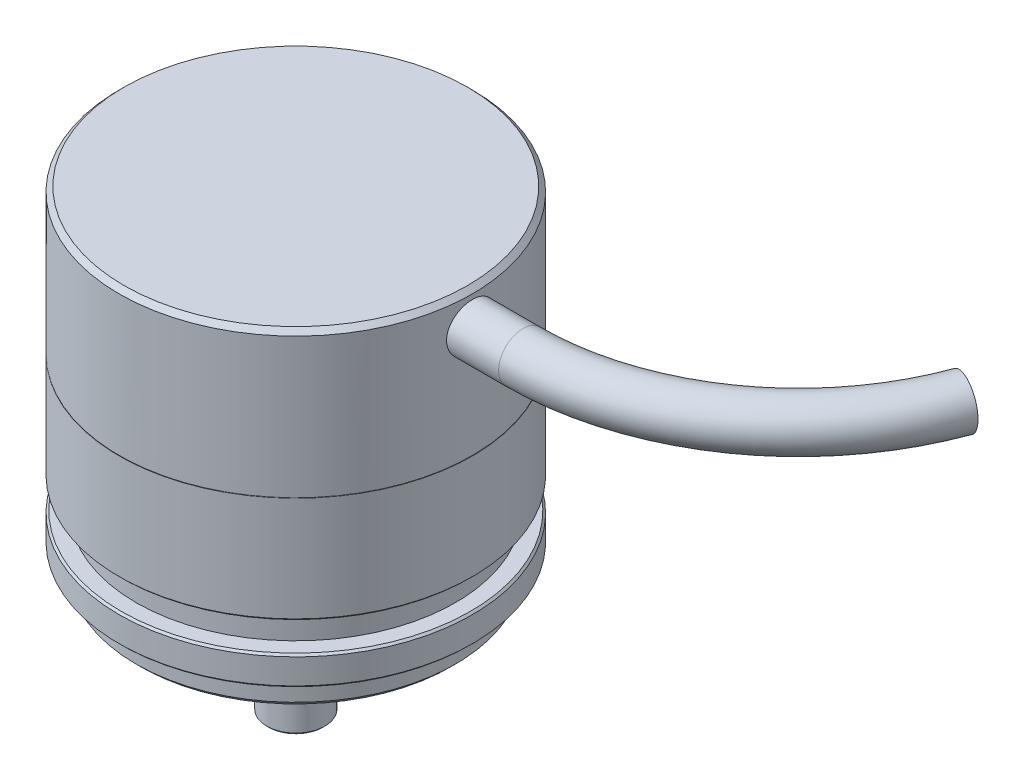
ISO-10303-21;
HEADER;
FILE_DESCRIPTION(('STEP AP214'),'2;1');
FILE_NAME('part.step','',(''),(''),'','','');
FILE_SCHEMA(('AUTOMOTIVE_DESIGN { 1 0 10303 214 1 1 1 1 }'));
ENDSEC;
DATA;
#1=APPLICATION_CONTEXT('core data for automotive mechanical design processes');
#2=APPLICATION_PROTOCOL_DEFINITION('international standard','automotive_design',2000,#1);
#3=PRODUCT_CONTEXT('',#1,'mechanical');
#4=PRODUCT('Part','Part','',(#3));
#5=PRODUCT_RELATED_PRODUCT_CATEGORY('part','',(#4));
#6=PRODUCT_DEFINITION_FORMATION('','',#4);
#7=PRODUCT_DEFINITION_CONTEXT('part definition',#1,'design');
#8=PRODUCT_DEFINITION('design','',#6,#7);
#9=PRODUCT_DEFINITION_SHAPE('','',#8);
#10=(LENGTH_UNIT() NAMED_UNIT(*) SI_UNIT(.MILLI.,.METRE.));
#11=(NAMED_UNIT(*) PLANE_ANGLE_UNIT() SI_UNIT($,.RADIAN.));
#12=(NAMED_UNIT(*) SI_UNIT($,.STERADIAN.) SOLID_ANGLE_UNIT());
#13=UNCERTAINTY_MEASURE_WITH_UNIT(LENGTH_MEASURE(1.E-05),#10,'distance_accuracy_value','');
#14=(GEOMETRIC_REPRESENTATION_CONTEXT(3) GLOBAL_UNCERTAINTY_ASSIGNED_CONTEXT((#13)) GLOBAL_UNIT_ASSIGNED_CONTEXT((#10,
#11,#12)) REPRESENTATION_CONTEXT('',''));
#15=CARTESIAN_POINT('',(0.,0.,0.));
#16=DIRECTION('',(0.,0.,1.));
#17=DIRECTION('',(1.,0.,0.));
#18=AXIS2_PLACEMENT_3D('',#15,#16,#17);
#19=CARTESIAN_POINT('',(31.5463232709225,-10.9999999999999,0.));
#20=DIRECTION('',(0.,-1.,0.));
#21=DIRECTION('',(0.,0.,-1.));
#22=AXIS2_PLACEMENT_3D('',#19,#20,#21);
#23=CYLINDRICAL_SURFACE('',#22,18.25);
#24=CARTESIAN_POINT('',(31.5463232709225,21.05,0.));
#25=DIRECTION('',(0.,-1.,0.));
#26=DIRECTION('',(0.,0.,-1.));
#27=AXIS2_PLACEMENT_3D('',#24,#25,#26);
#28=CIRCLE('',#27,18.25);
#29=CARTESIAN_POINT('',(31.5463232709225,21.05,-18.25));
#30=VERTEX_POINT('',#29);
#31=EDGE_CURVE('E83',#30,#30,#28,.T.);
#32=ORIENTED_EDGE('',*,*,#31,.F.);
#33=EDGE_LOOP('',(#32));
#34=FACE_BOUND('',#33,.T.);
#35=CARTESIAN_POINT('',(31.5463232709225,35.5000000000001,0.));
#36=DIRECTION('',(0.,1.,0.));
#37=DIRECTION('',(0.,0.,1.));
#38=AXIS2_PLACEMENT_3D('',#35,#36,#37);
#39=CIRCLE('',#38,18.25);
#40=CARTESIAN_POINT('',(31.5463232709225,35.5000000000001,18.25));
#41=VERTEX_POINT('',#40);
#42=EDGE_CURVE('E134',#41,#41,#39,.F.);
#43=ORIENTED_EDGE('',*,*,#42,.T.);
#44=EDGE_LOOP('',(#43));
#45=FACE_BOUND('',#44,.T.);
#46=CARTESIAN_POINT('',(49.6242794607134,32.5000000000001,2.5));
#47=CARTESIAN_POINT('',(49.6242816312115,32.6397174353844,2.49999413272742));
#48=CARTESIAN_POINT('',(49.625916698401,32.77951935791,2.48824786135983));
#49=CARTESIAN_POINT('',(49.6322769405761,33.0552242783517,2.44158003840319));
#50=CARTESIAN_POINT('',(49.6370052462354,33.1911231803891,2.40663500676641));
#51=CARTESIAN_POINT('',(49.6490065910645,33.4549908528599,2.31462632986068));
#52=CARTESIAN_POINT('',(49.656277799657,33.5829652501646,2.25757859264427));
#53=CARTESIAN_POINT('',(49.6725434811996,33.8275035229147,2.12301957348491));
#54=CARTESIAN_POINT('',(49.6815376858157,33.9440691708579,2.0455114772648));
#55=CARTESIAN_POINT('',(49.7003033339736,34.1632828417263,1.8716768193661));
#56=CARTESIAN_POINT('',(49.7100791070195,34.2658433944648,1.7752404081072));
#57=CARTESIAN_POINT('',(49.7292676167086,34.4533788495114,1.56652348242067));
#58=CARTESIAN_POINT('',(49.7386803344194,34.5383528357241,1.45424214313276));
#59=CARTESIAN_POINT('',(49.7561269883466,34.6886212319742,1.21646759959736));
#60=CARTESIAN_POINT('',(49.7641552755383,34.7538357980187,1.0909234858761));
#61=CARTESIAN_POINT('',(49.7778807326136,34.8622223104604,0.830536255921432));
#62=CARTESIAN_POINT('',(49.7835780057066,34.905395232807,0.695693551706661));
#63=CARTESIAN_POINT('',(49.7919689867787,34.9682097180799,0.421434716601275));
#64=CARTESIAN_POINT('',(49.7946813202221,34.9879972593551,0.28205259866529));
#65=CARTESIAN_POINT('',(49.7968605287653,35.0039320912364,0.00192162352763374));
#66=CARTESIAN_POINT('',(49.7963275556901,35.0000804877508,-0.138827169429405));
#67=CARTESIAN_POINT('',(49.7920911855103,34.968962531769,-0.41670170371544));
#68=CARTESIAN_POINT('',(49.7884090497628,34.9418531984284,-0.553845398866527));
#69=CARTESIAN_POINT('',(49.7783118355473,34.8652352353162,-0.821618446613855));
#70=CARTESIAN_POINT('',(49.7718966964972,34.815726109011,-0.952247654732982));
#71=CARTESIAN_POINT('',(49.7570176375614,34.6955498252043,-1.20376478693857));
#72=CARTESIAN_POINT('',(49.7485472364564,34.6248155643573,-1.32462024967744));
#73=CARTESIAN_POINT('',(49.7305036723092,34.4642457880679,-1.55280520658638));
#74=CARTESIAN_POINT('',(49.7209304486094,34.3744092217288,-1.66013395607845));
#75=CARTESIAN_POINT('',(49.7016581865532,34.1773076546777,-1.85914274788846));
#76=CARTESIAN_POINT('',(49.6919587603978,34.0699056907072,-1.95068715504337));
#77=CARTESIAN_POINT('',(49.6736043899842,33.8411901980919,-2.11447221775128));
#78=CARTESIAN_POINT('',(49.6649494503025,33.7198766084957,-2.18671278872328));
#79=CARTESIAN_POINT('',(49.6496642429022,33.4666513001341,-2.30985209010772));
#80=CARTESIAN_POINT('',(49.6430351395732,33.3347335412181,-2.36073855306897));
#81=CARTESIAN_POINT('',(49.6325738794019,33.0641136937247,-2.43959751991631));
#82=CARTESIAN_POINT('',(49.628741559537,32.9254120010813,-2.46757135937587));
#83=CARTESIAN_POINT('',(49.6243381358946,32.6463634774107,-2.4996284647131));
#84=CARTESIAN_POINT('',(49.6237408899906,32.5060390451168,-2.5039032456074));
#85=CARTESIAN_POINT('',(49.6258059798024,32.2266759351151,-2.48894751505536));
#86=CARTESIAN_POINT('',(49.628468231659,32.0876372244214,-2.46971760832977));
#87=CARTESIAN_POINT('',(49.6367284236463,31.8153751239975,-2.40846016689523));
#88=CARTESIAN_POINT('',(49.6423142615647,31.6821301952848,-2.36652658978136));
#89=CARTESIAN_POINT('',(49.6557823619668,31.4245616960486,-2.26114932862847));
#90=CARTESIAN_POINT('',(49.663664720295,31.3002384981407,-2.19770474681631));
#91=CARTESIAN_POINT('',(49.6808998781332,31.0631797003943,-2.05064048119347));
#92=CARTESIAN_POINT('',(49.6902616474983,30.9505222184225,-1.96689594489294));
#93=CARTESIAN_POINT('',(49.7093731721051,30.7407925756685,-1.78178411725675));
#94=CARTESIAN_POINT('',(49.719122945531,30.6437211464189,-1.68041599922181));
#95=CARTESIAN_POINT('',(49.7379928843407,30.4672394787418,-1.46209472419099));
#96=CARTESIAN_POINT('',(49.7471082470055,30.38795558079,-1.34503896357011));
#97=CARTESIAN_POINT('',(49.7636092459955,30.2501764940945,-1.09915992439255));
#98=CARTESIAN_POINT('',(49.7709949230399,30.1916808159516,-0.970336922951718));
#99=CARTESIAN_POINT('',(49.7831832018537,30.0973441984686,-0.704988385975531));
#100=CARTESIAN_POINT('',(49.7879939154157,30.0614320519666,-0.56848855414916));
#101=CARTESIAN_POINT('',(49.7945240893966,30.01305077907,-0.291325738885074));
#102=CARTESIAN_POINT('',(49.7962437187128,30.0005803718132,-0.150662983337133));
#103=CARTESIAN_POINT('',(49.7963967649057,29.9994638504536,0.129602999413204));
#104=CARTESIAN_POINT('',(49.7948569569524,30.0106236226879,0.269205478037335));
#105=CARTESIAN_POINT('',(49.7887176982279,30.0560372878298,0.544529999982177));
#106=CARTESIAN_POINT('',(49.7841182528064,30.0902911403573,0.680252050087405));
#107=CARTESIAN_POINT('',(49.7723740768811,30.1808559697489,0.943924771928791));
#108=CARTESIAN_POINT('',(49.7652306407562,30.2371557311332,1.07187935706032));
#109=CARTESIAN_POINT('',(49.7491865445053,30.3701939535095,1.31655594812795));
#110=CARTESIAN_POINT('',(49.7402858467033,30.446932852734,1.43327771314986));
#111=CARTESIAN_POINT('',(49.7216317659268,30.6193820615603,1.65316406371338));
#112=CARTESIAN_POINT('',(49.7118722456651,30.7152363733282,1.7562152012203));
#113=CARTESIAN_POINT('',(49.6926479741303,30.9228936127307,1.94484275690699));
#114=CARTESIAN_POINT('',(49.6831832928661,31.0347002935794,2.03041505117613));
#115=CARTESIAN_POINT('',(49.6655733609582,31.2716923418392,2.18200466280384));
#116=CARTESIAN_POINT('',(49.6574344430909,31.3969374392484,2.24792930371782));
#117=CARTESIAN_POINT('',(49.6434716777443,31.6567681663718,2.3577126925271));
#118=CARTESIAN_POINT('',(49.6376453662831,31.7913436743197,2.40159493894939));
#119=CARTESIAN_POINT('',(49.6303510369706,32.0221459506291,2.45579041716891));
#120=CARTESIAN_POINT('',(49.6280858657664,32.1169299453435,2.47234448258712));
#121=CARTESIAN_POINT('',(49.6250493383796,32.3077959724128,2.49445123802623));
#122=CARTESIAN_POINT('',(49.6242779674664,32.4038779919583,2.50000403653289));
#123=CARTESIAN_POINT('',(49.6242794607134,32.5000000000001,2.5));
#124=B_SPLINE_CURVE_WITH_KNOTS('',3,(#46,#47,#48,#49,#50,#51,#52,#53,#54,#55,#56,#57,#58,#59,
#60,#61,#62,#63,#64,#65,#66,#67,#68,#69,#70,#71,#72,#73,#74,#75,#76,#77,#78,#79,#80,#81,#82,#83,
#84,#85,#86,#87,#88,#89,#90,#91,#92,#93,#94,#95,#96,#97,#98,#99,#100,#101,#102,#103,#104,#105,
#106,#107,#108,#109,#110,#111,#112,#113,#114,#115,#116,#117,#118,#119,#120,#121,#122,#123),
.UNSPECIFIED.,.T.,.F.,(4,2,2,2,2,2,2,2,2,2,2,2,2,2,2,2,2,2,2,2,2,2,2,2,2,2,2,2,2,2,2,2,2,2,2,2,
2,2,4),(0.,0.418801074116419,0.838026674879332,1.2569511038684,1.67581034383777,
2.09717639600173,2.5185643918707,2.94163309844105,3.36468307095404,3.78507805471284,
4.20545337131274,4.62301275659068,5.04058139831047,5.45948434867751,5.87841035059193,
6.3007739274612,6.72313935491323,7.14574709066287,7.56833019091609,7.98749331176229,
8.40664564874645,8.82407646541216,9.2415247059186,9.66160863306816,10.0817122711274,
10.5047114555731,10.9277006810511,11.3493494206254,11.7709751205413,12.1891507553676,
12.6073256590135,13.0252880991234,13.4432595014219,13.864507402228,14.2858545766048,
14.7091588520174,15.1320108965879,15.420138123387,15.7082625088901),.UNSPECIFIED.);
#125=CARTESIAN_POINT('',(49.6242794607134,32.5000000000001,2.5));
#126=VERTEX_POINT('',#125);
#127=EDGE_CURVE('E82',#126,#126,#124,.T.);
#128=ORIENTED_EDGE('',*,*,#127,.T.);
#129=EDGE_LOOP('',(#128));
#130=FACE_BOUND('',#129,.T.);
#131=ADVANCED_FACE('F35',(#34,#45,#130),#23,.T.);
#132=CARTESIAN_POINT('',(31.5463232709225,-10.9999999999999,0.));
#133=DIRECTION('',(0.,-1.,0.));
#134=DIRECTION('',(0.,0.,-1.));
#135=AXIS2_PLACEMENT_3D('',#132,#133,#134);
#136=PLANE('',#135);
#137=CARTESIAN_POINT('',(31.5463232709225,-10.9999999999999,0.));
#138=DIRECTION('',(0.,-1.,0.));
#139=DIRECTION('',(0.,0.,-1.));
#140=AXIS2_PLACEMENT_3D('',#137,#138,#139);
#141=CIRCLE('',#140,2.8);
#142=CARTESIAN_POINT('',(31.5463232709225,-10.9999999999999,-2.8));
#143=VERTEX_POINT('',#142);
#144=EDGE_CURVE('E592',#143,#143,#141,.T.);
#145=ORIENTED_EDGE('',*,*,#144,.T.);
#146=EDGE_LOOP('',(#145));
#147=FACE_BOUND('',#146,.T.);
#148=ADVANCED_FACE('F180',(#147),#136,.T.);
#149=CARTESIAN_POINT('',(31.5463232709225,-10.9999999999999,0.));
#150=DIRECTION('',(0.,-1.,0.));
#151=DIRECTION('',(0.,0.,-1.));
#152=AXIS2_PLACEMENT_3D('',#149,#150,#151);
#153=CYLINDRICAL_SURFACE('',#152,3.);
#154=CARTESIAN_POINT('',(31.5463232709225,-10.7999999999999,0.));
#155=DIRECTION('',(0.,-1.,0.));
#156=DIRECTION('',(0.,0.,-1.));
#157=AXIS2_PLACEMENT_3D('',#154,#155,#156);
#158=CIRCLE('',#157,3.);
#159=CARTESIAN_POINT('',(31.5463232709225,-10.7999999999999,-3.));
#160=VERTEX_POINT('',#159);
#161=EDGE_CURVE('E589',#160,#160,#158,.F.);
#162=ORIENTED_EDGE('',*,*,#161,.T.);
#163=EDGE_LOOP('',(#162));
#164=FACE_BOUND('',#163,.T.);
#165=CARTESIAN_POINT('',(31.5463232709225,1.1,0.));
#166=DIRECTION('',(0.,-1.,0.));
#167=DIRECTION('',(0.,0.,-1.));
#168=AXIS2_PLACEMENT_3D('',#165,#166,#167);
#169=CIRCLE('',#168,3.);
#170=CARTESIAN_POINT('',(31.5463232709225,1.1,-3.));
#171=VERTEX_POINT('',#170);
#172=EDGE_CURVE('E131',#171,#171,#169,.T.);
#173=ORIENTED_EDGE('',*,*,#172,.T.);
#174=EDGE_LOOP('',(#173));
#175=FACE_BOUND('',#174,.T.);
#176=ADVANCED_FACE('F185',(#164,#175),#153,.T.);
#177=CARTESIAN_POINT('',(31.5463232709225,1.1,0.));
#178=DIRECTION('',(0.,-1.,0.));
#179=DIRECTION('',(0.,0.,-1.));
#180=AXIS2_PLACEMENT_3D('',#177,#178,#179);
#181=CONICAL_SURFACE('',#180,3.,0.803447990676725);
#182=CARTESIAN_POINT('',(31.5463232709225,0.999999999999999,0.));
#183=DIRECTION('',(0.,-1.,0.));
#184=DIRECTION('',(0.,0.,-1.));
#185=AXIS2_PLACEMENT_3D('',#182,#183,#184);
#186=CIRCLE('',#185,3.10367672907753);
#187=CARTESIAN_POINT('',(31.5463232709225,0.999999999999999,-3.10367672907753));
#188=VERTEX_POINT('',#187);
#189=EDGE_CURVE('E128',#188,#188,#186,.T.);
#190=ORIENTED_EDGE('',*,*,#189,.T.);
#191=EDGE_LOOP('',(#190));
#192=FACE_BOUND('',#191,.T.);
#193=ORIENTED_EDGE('',*,*,#172,.F.);
#194=EDGE_LOOP('',(#193));
#195=FACE_BOUND('',#194,.T.);
#196=ADVANCED_FACE('F559',(#192,#195),#181,.F.);
#197=CARTESIAN_POINT('',(34.65,1.,0.));
#198=DIRECTION('',(0.,-1.,0.));
#199=DIRECTION('',(0.,0.,-1.));
#200=AXIS2_PLACEMENT_3D('',#197,#198,#199);
#201=PLANE('',#200);
#202=CARTESIAN_POINT('',(31.5463232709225,0.999999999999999,0.));
#203=DIRECTION('',(0.,-1.,0.));
#204=DIRECTION('',(0.,0.,-1.));
#205=AXIS2_PLACEMENT_3D('',#202,#203,#204);
#206=CIRCLE('',#205,3.85367672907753);
#207=CARTESIAN_POINT('',(31.5463232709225,0.999999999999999,-3.85367672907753));
#208=VERTEX_POINT('',#207);
#209=EDGE_CURVE('E125',#208,#208,#206,.T.);
#210=ORIENTED_EDGE('',*,*,#209,.T.);
#211=EDGE_LOOP('',(#210));
#212=FACE_BOUND('',#211,.T.);
#213=ORIENTED_EDGE('',*,*,#189,.F.);
#214=EDGE_LOOP('',(#213));
#215=FACE_BOUND('',#214,.T.);
#216=ADVANCED_FACE('F549',(#212,#215),#201,.T.);
#217=CARTESIAN_POINT('',(31.5463232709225,-10.9999999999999,0.));
#218=DIRECTION('',(0.,-1.,0.));
#219=DIRECTION('',(0.,0.,-1.));
#220=AXIS2_PLACEMENT_3D('',#217,#218,#219);
#221=CYLINDRICAL_SURFACE('',#220,3.85367672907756);
#222=CARTESIAN_POINT('',(31.5463232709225,1.09999999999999,0.));
#223=DIRECTION('',(0.,-1.,0.));
#224=DIRECTION('',(0.,0.,-1.));
#225=AXIS2_PLACEMENT_3D('',#222,#223,#224);
#226=CIRCLE('',#225,3.85367672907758);
#227=CARTESIAN_POINT('',(31.5463232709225,1.09999999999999,-3.85367672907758));
#228=VERTEX_POINT('',#227);
#229=EDGE_CURVE('E122',#228,#228,#226,.T.);
#230=ORIENTED_EDGE('',*,*,#229,.T.);
#231=EDGE_LOOP('',(#230));
#232=FACE_BOUND('',#231,.T.);
#233=ORIENTED_EDGE('',*,*,#209,.F.);
#234=EDGE_LOOP('',(#233));
#235=FACE_BOUND('',#234,.T.);
#236=ADVANCED_FACE('F537',(#232,#235),#221,.T.);
#237=CARTESIAN_POINT('',(39.5,1.1,0.));
#238=DIRECTION('',(0.,-1.,0.));
#239=DIRECTION('',(0.,0.,-1.));
#240=AXIS2_PLACEMENT_3D('',#237,#238,#239);
#241=PLANE('',#240);
#242=CARTESIAN_POINT('',(31.5463232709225,1.1,0.));
#243=DIRECTION('',(0.,-1.,0.));
#244=DIRECTION('',(0.,0.,-1.));
#245=AXIS2_PLACEMENT_3D('',#242,#243,#244);
#246=CIRCLE('',#245,8.20367672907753);
#247=CARTESIAN_POINT('',(31.5463232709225,1.1,-8.20367672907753));
#248=VERTEX_POINT('',#247);
#249=EDGE_CURVE('E119',#248,#248,#246,.T.);
#250=ORIENTED_EDGE('',*,*,#249,.T.);
#251=EDGE_LOOP('',(#250));
#252=FACE_BOUND('',#251,.T.);
#253=ORIENTED_EDGE('',*,*,#229,.F.);
#254=EDGE_LOOP('',(#253));
#255=FACE_BOUND('',#254,.T.);
#256=ADVANCED_FACE('F528',(#252,#255),#241,.T.);
#257=CARTESIAN_POINT('',(31.5463232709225,-10.9999999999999,0.));
#258=DIRECTION('',(0.,-1.,0.));
#259=DIRECTION('',(0.,0.,-1.));
#260=AXIS2_PLACEMENT_3D('',#257,#258,#259);
#261=CYLINDRICAL_SURFACE('',#260,8.20367672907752);
#262=CARTESIAN_POINT('',(31.5463232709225,1.01470093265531,0.));
#263=DIRECTION('',(0.,-1.,0.));
#264=DIRECTION('',(0.,0.,-1.));
#265=AXIS2_PLACEMENT_3D('',#262,#263,#264);
#266=CIRCLE('',#265,8.20367672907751);
#267=CARTESIAN_POINT('',(31.5463232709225,1.01470093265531,-8.20367672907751));
#268=VERTEX_POINT('',#267);
#269=EDGE_CURVE('E116',#268,#268,#266,.T.);
#270=ORIENTED_EDGE('',*,*,#269,.T.);
#271=EDGE_LOOP('',(#270));
#272=FACE_BOUND('',#271,.T.);
#273=ORIENTED_EDGE('',*,*,#249,.F.);
#274=EDGE_LOOP('',(#273));
#275=FACE_BOUND('',#274,.T.);
#276=ADVANCED_FACE('F519',(#272,#275),#261,.F.);
#277=CARTESIAN_POINT('',(39.75,1.01470093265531,0.));
#278=DIRECTION('',(0.,-1.,0.));
#279=DIRECTION('',(0.,0.,-1.));
#280=AXIS2_PLACEMENT_3D('',#277,#278,#279);
#281=PLANE('',#280);
#282=CARTESIAN_POINT('',(31.5463232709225,1.01470093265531,0.));
#283=DIRECTION('',(0.,-1.,0.));
#284=DIRECTION('',(0.,0.,-1.));
#285=AXIS2_PLACEMENT_3D('',#282,#283,#284);
#286=CIRCLE('',#285,9.435061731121);
#287=CARTESIAN_POINT('',(31.5463232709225,1.01470093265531,-9.435061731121));
#288=VERTEX_POINT('',#287);
#289=EDGE_CURVE('E113',#288,#288,#286,.T.);
#290=ORIENTED_EDGE('',*,*,#289,.T.);
#291=EDGE_LOOP('',(#290));
#292=FACE_BOUND('',#291,.T.);
#293=ORIENTED_EDGE('',*,*,#269,.F.);
#294=EDGE_LOOP('',(#293));
#295=FACE_BOUND('',#294,.T.);
#296=ADVANCED_FACE('F510',(#292,#295),#281,.T.);
#297=CARTESIAN_POINT('',(31.5463232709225,-10.9999999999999,0.));
#298=DIRECTION('',(0.,-1.,0.));
#299=DIRECTION('',(0.,0.,-1.));
#300=AXIS2_PLACEMENT_3D('',#297,#298,#299);
#301=CYLINDRICAL_SURFACE('',#300,9.43506173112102);
#302=CARTESIAN_POINT('',(31.5463232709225,1.09999999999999,0.));
#303=DIRECTION('',(0.,-1.,0.));
#304=DIRECTION('',(0.,0.,-1.));
#305=AXIS2_PLACEMENT_3D('',#302,#303,#304);
#306=CIRCLE('',#305,9.43506173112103);
#307=CARTESIAN_POINT('',(31.5463232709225,1.09999999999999,-9.43506173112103));
#308=VERTEX_POINT('',#307);
#309=EDGE_CURVE('E110',#308,#308,#306,.T.);
#310=ORIENTED_EDGE('',*,*,#309,.T.);
#311=EDGE_LOOP('',(#310));
#312=FACE_BOUND('',#311,.T.);
#313=ORIENTED_EDGE('',*,*,#289,.F.);
#314=EDGE_LOOP('',(#313));
#315=FACE_BOUND('',#314,.T.);
#316=ADVANCED_FACE('F501',(#312,#315),#301,.T.);
#317=CARTESIAN_POINT('',(40.9813850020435,1.10000000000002,0.));
#318=DIRECTION('',(0.,-1.,0.));
#319=DIRECTION('',(0.,0.,-1.));
#320=AXIS2_PLACEMENT_3D('',#317,#318,#319);
#321=PLANE('',#320);
#322=CARTESIAN_POINT('',(31.5463232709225,1.10000000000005,0.));
#323=DIRECTION('',(0.,-1.,0.));
#324=DIRECTION('',(0.,0.,-1.));
#325=AXIS2_PLACEMENT_3D('',#322,#323,#324);
#326=CIRCLE('',#325,9.54999999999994);
#327=CARTESIAN_POINT('',(31.5463232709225,1.10000000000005,-9.54999999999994));
#328=VERTEX_POINT('',#327);
#329=EDGE_CURVE('E107',#328,#328,#326,.T.);
#330=ORIENTED_EDGE('',*,*,#329,.T.);
#331=EDGE_LOOP('',(#330));
#332=FACE_BOUND('',#331,.T.);
#333=ORIENTED_EDGE('',*,*,#309,.F.);
#334=EDGE_LOOP('',(#333));
#335=FACE_BOUND('',#334,.T.);
#336=ADVANCED_FACE('F492',(#332,#335),#321,.T.);
#337=CARTESIAN_POINT('',(31.5463232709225,-10.9999999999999,0.));
#338=DIRECTION('',(0.,-1.,0.));
#339=DIRECTION('',(0.,0.,-1.));
#340=AXIS2_PLACEMENT_3D('',#337,#338,#339);
#341=CYLINDRICAL_SURFACE('',#340,9.54999999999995);
#342=CARTESIAN_POINT('',(31.5463232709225,1.00000000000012,0.));
#343=DIRECTION('',(0.,-1.,0.));
#344=DIRECTION('',(0.,0.,-1.));
#345=AXIS2_PLACEMENT_3D('',#342,#343,#344);
#346=CIRCLE('',#345,9.54999999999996);
#347=CARTESIAN_POINT('',(31.5463232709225,1.00000000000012,-9.54999999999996));
#348=VERTEX_POINT('',#347);
#349=EDGE_CURVE('E104',#348,#348,#346,.T.);
#350=ORIENTED_EDGE('',*,*,#349,.T.);
#351=EDGE_LOOP('',(#350));
#352=FACE_BOUND('',#351,.T.);
#353=ORIENTED_EDGE('',*,*,#329,.F.);
#354=EDGE_LOOP('',(#353));
#355=FACE_BOUND('',#354,.T.);
#356=ADVANCED_FACE('F483',(#352,#355),#341,.F.);
#357=CARTESIAN_POINT('',(41.0963232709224,1.00000000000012,0.));
#358=DIRECTION('',(0.,-1.,0.));
#359=DIRECTION('',(0.,0.,-1.));
#360=AXIS2_PLACEMENT_3D('',#357,#358,#359);
#361=PLANE('',#360);
#362=CARTESIAN_POINT('',(22.3539351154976,1.00000000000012,-9.19238815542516));
#363=DIRECTION('',(0.,-1.,0.));
#364=DIRECTION('',(0.,0.,-1.));
#365=AXIS2_PLACEMENT_3D('',#362,#363,#364);
#366=CIRCLE('',#365,1.55);
#367=CARTESIAN_POINT('',(22.3539351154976,1.00000000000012,-10.7423881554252));
#368=VERTEX_POINT('',#367);
#369=EDGE_CURVE('E607',#368,#368,#366,.F.);
#370=ORIENTED_EDGE('',*,*,#369,.T.);
#371=EDGE_LOOP('',(#370));
#372=FACE_BOUND('',#371,.T.);
#373=CARTESIAN_POINT('',(40.7387114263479,1.00000000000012,-9.19238815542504));
#374=DIRECTION('',(0.,-1.,0.));
#375=DIRECTION('',(0.,0.,-1.));
#376=AXIS2_PLACEMENT_3D('',#373,#374,#375);
#377=CIRCLE('',#376,1.55);
#378=CARTESIAN_POINT('',(40.7387114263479,1.00000000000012,-10.742388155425));
#379=VERTEX_POINT('',#378);
#380=EDGE_CURVE('E610',#379,#379,#377,.F.);
#381=ORIENTED_EDGE('',*,*,#380,.T.);
#382=EDGE_LOOP('',(#381));
#383=FACE_BOUND('',#382,.T.);
#384=CARTESIAN_POINT('',(40.7387114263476,1.00000000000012,9.19238815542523));
#385=DIRECTION('',(0.,-1.,0.));
#386=DIRECTION('',(0.,0.,-1.));
#387=AXIS2_PLACEMENT_3D('',#384,#385,#386);
#388=CIRCLE('',#387,1.55);
#389=CARTESIAN_POINT('',(40.7387114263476,1.00000000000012,7.64238815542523));
#390=VERTEX_POINT('',#389);
#391=EDGE_CURVE('E613',#390,#390,#388,.F.);
#392=ORIENTED_EDGE('',*,*,#391,.T.);
#393=EDGE_LOOP('',(#392));
#394=FACE_BOUND('',#393,.T.);
#395=CARTESIAN_POINT('',(22.3539351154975,1.00000000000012,9.19238815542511));
#396=DIRECTION('',(0.,-1.,0.));
#397=DIRECTION('',(0.,0.,-1.));
#398=AXIS2_PLACEMENT_3D('',#395,#396,#397);
#399=CIRCLE('',#398,1.55);
#400=CARTESIAN_POINT('',(22.3539351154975,1.00000000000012,7.64238815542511));
#401=VERTEX_POINT('',#400);
#402=EDGE_CURVE('E616',#401,#401,#399,.F.);
#403=ORIENTED_EDGE('',*,*,#402,.T.);
#404=EDGE_LOOP('',(#403));
#405=FACE_BOUND('',#404,.T.);
#406=CARTESIAN_POINT('',(31.5463232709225,1.00000000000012,0.));
#407=DIRECTION('',(0.,-1.,0.));
#408=DIRECTION('',(0.,0.,-1.));
#409=AXIS2_PLACEMENT_3D('',#406,#407,#408);
#410=CIRCLE('',#409,16.);
#411=CARTESIAN_POINT('',(31.5463232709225,1.00000000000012,-16.));
#412=VERTEX_POINT('',#411);
#413=EDGE_CURVE('E140',#412,#412,#410,.T.);
#414=ORIENTED_EDGE('',*,*,#413,.T.);
#415=EDGE_LOOP('',(#414));
#416=FACE_BOUND('',#415,.T.);
#417=ORIENTED_EDGE('',*,*,#349,.F.);
#418=EDGE_LOOP('',(#417));
#419=FACE_BOUND('',#418,.T.);
#420=ADVANCED_FACE('F475',(#372,#383,#394,#405,#416,#419),#361,.T.);
#421=CARTESIAN_POINT('',(31.5463232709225,-10.9999999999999,0.));
#422=DIRECTION('',(0.,-1.,0.));
#423=DIRECTION('',(0.,0.,-1.));
#424=AXIS2_PLACEMENT_3D('',#421,#422,#423);
#425=CYLINDRICAL_SURFACE('',#424,16.5);
#426=CARTESIAN_POINT('',(31.5463232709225,1.50000000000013,0.));
#427=DIRECTION('',(0.,-1.,0.));
#428=DIRECTION('',(0.,0.,-1.));
#429=AXIS2_PLACEMENT_3D('',#426,#427,#428);
#430=CIRCLE('',#429,16.5);
#431=CARTESIAN_POINT('',(31.5463232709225,1.50000000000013,-16.5));
#432=VERTEX_POINT('',#431);
#433=EDGE_CURVE('E143',#432,#432,#430,.F.);
#434=ORIENTED_EDGE('',*,*,#433,.T.);
#435=EDGE_LOOP('',(#434));
#436=FACE_BOUND('',#435,.T.);
#437=CARTESIAN_POINT('',(31.5463232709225,4.00000000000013,0.));
#438=DIRECTION('',(0.,-1.,0.));
#439=DIRECTION('',(0.,0.,-1.));
#440=AXIS2_PLACEMENT_3D('',#437,#438,#439);
#441=CIRCLE('',#440,16.5);
#442=CARTESIAN_POINT('',(31.5463232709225,4.00000000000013,-16.5));
#443=VERTEX_POINT('',#442);
#444=EDGE_CURVE('E101',#443,#443,#441,.T.);
#445=ORIENTED_EDGE('',*,*,#444,.T.);
#446=EDGE_LOOP('',(#445));
#447=FACE_BOUND('',#446,.T.);
#448=ADVANCED_FACE('F466',(#436,#447),#425,.T.);
#449=CARTESIAN_POINT('',(49.7963232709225,4.00000000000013,0.));
#450=DIRECTION('',(0.,-1.,0.));
#451=DIRECTION('',(0.,0.,-1.));
#452=AXIS2_PLACEMENT_3D('',#449,#450,#451);
#453=PLANE('',#452);
#454=CARTESIAN_POINT('',(31.5463232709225,4.00000000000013,0.));
#455=DIRECTION('',(0.,-1.,0.));
#456=DIRECTION('',(0.,0.,-1.));
#457=AXIS2_PLACEMENT_3D('',#454,#455,#456);
#458=CIRCLE('',#457,18.05);
#459=CARTESIAN_POINT('',(31.5463232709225,4.00000000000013,-18.05));
#460=VERTEX_POINT('',#459);
#461=EDGE_CURVE('E146',#460,#460,#458,.T.);
#462=ORIENTED_EDGE('',*,*,#461,.T.);
#463=EDGE_LOOP('',(#462));
#464=FACE_BOUND('',#463,.T.);
#465=ORIENTED_EDGE('',*,*,#444,.F.);
#466=EDGE_LOOP('',(#465));
#467=FACE_BOUND('',#466,.T.);
#468=ADVANCED_FACE('F457',(#464,#467),#453,.T.);
#469=CARTESIAN_POINT('',(31.5463232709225,-10.9999999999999,0.));
#470=DIRECTION('',(0.,-1.,0.));
#471=DIRECTION('',(0.,0.,-1.));
#472=AXIS2_PLACEMENT_3D('',#469,#470,#471);
#473=CYLINDRICAL_SURFACE('',#472,18.25);
#474=CARTESIAN_POINT('',(31.5463232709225,4.20000000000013,0.));
#475=DIRECTION('',(0.,-1.,0.));
#476=DIRECTION('',(0.,0.,-1.));
#477=AXIS2_PLACEMENT_3D('',#474,#475,#476);
#478=CIRCLE('',#477,18.25);
#479=CARTESIAN_POINT('',(31.5463232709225,4.20000000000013,-18.25));
#480=VERTEX_POINT('',#479);
#481=EDGE_CURVE('E625',#480,#480,#478,.F.);
#482=ORIENTED_EDGE('',*,*,#481,.T.);
#483=EDGE_LOOP('',(#482));
#484=FACE_BOUND('',#483,.T.);
#485=CARTESIAN_POINT('',(31.5463232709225,6.80000000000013,0.));
#486=DIRECTION('',(0.,1.,0.));
#487=DIRECTION('',(0.,0.,1.));
#488=AXIS2_PLACEMENT_3D('',#485,#486,#487);
#489=CIRCLE('',#488,18.25);
#490=CARTESIAN_POINT('',(31.5463232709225,6.80000000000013,18.25));
#491=VERTEX_POINT('',#490);
#492=EDGE_CURVE('E627',#491,#491,#489,.F.);
#493=ORIENTED_EDGE('',*,*,#492,.T.);
#494=EDGE_LOOP('',(#493));
#495=FACE_BOUND('',#494,.T.);
#496=ADVANCED_FACE('F448',(#484,#495),#473,.T.);
#497=CARTESIAN_POINT('',(49.7963232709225,7.00000000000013,0.));
#498=DIRECTION('',(0.,1.,0.));
#499=DIRECTION('',(0.,0.,1.));
#500=AXIS2_PLACEMENT_3D('',#497,#498,#499);
#501=PLANE('',#500);
#502=CARTESIAN_POINT('',(31.5463232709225,7.00000000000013,0.));
#503=DIRECTION('',(0.,1.,0.));
#504=DIRECTION('',(0.,0.,1.));
#505=AXIS2_PLACEMENT_3D('',#502,#503,#504);
#506=CIRCLE('',#505,18.05);
#507=CARTESIAN_POINT('',(31.5463232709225,7.00000000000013,18.05));
#508=VERTEX_POINT('',#507);
#509=EDGE_CURVE('E622',#508,#508,#506,.T.);
#510=ORIENTED_EDGE('',*,*,#509,.T.);
#511=EDGE_LOOP('',(#510));
#512=FACE_BOUND('',#511,.T.);
#513=CARTESIAN_POINT('',(31.5463232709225,7.00000000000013,0.));
#514=DIRECTION('',(0.,-1.,0.));
#515=DIRECTION('',(0.,0.,-1.));
#516=AXIS2_PLACEMENT_3D('',#513,#514,#515);
#517=CIRCLE('',#516,16.5);
#518=CARTESIAN_POINT('',(31.5463232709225,7.00000000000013,-16.5));
#519=VERTEX_POINT('',#518);
#520=EDGE_CURVE('E98',#519,#519,#517,.T.);
#521=ORIENTED_EDGE('',*,*,#520,.T.);
#522=EDGE_LOOP('',(#521));
#523=FACE_BOUND('',#522,.T.);
#524=ADVANCED_FACE('F439',(#512,#523),#501,.T.);
#525=CARTESIAN_POINT('',(31.5463232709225,-10.9999999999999,0.));
#526=DIRECTION('',(0.,-1.,0.));
#527=DIRECTION('',(0.,0.,-1.));
#528=AXIS2_PLACEMENT_3D('',#525,#526,#527);
#529=CYLINDRICAL_SURFACE('',#528,16.5);
#530=CARTESIAN_POINT('',(31.5463232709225,10.0000000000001,0.));
#531=DIRECTION('',(0.,-1.,0.));
#532=DIRECTION('',(0.,0.,-1.));
#533=AXIS2_PLACEMENT_3D('',#530,#531,#532);
#534=CIRCLE('',#533,16.5);
#535=CARTESIAN_POINT('',(31.5463232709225,10.0000000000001,-16.5));
#536=VERTEX_POINT('',#535);
#537=EDGE_CURVE('E95',#536,#536,#534,.T.);
#538=ORIENTED_EDGE('',*,*,#537,.T.);
#539=EDGE_LOOP('',(#538));
#540=FACE_BOUND('',#539,.T.);
#541=ORIENTED_EDGE('',*,*,#520,.F.);
#542=EDGE_LOOP('',(#541));
#543=FACE_BOUND('',#542,.T.);
#544=ADVANCED_FACE('F430',(#540,#543),#529,.T.);
#545=CARTESIAN_POINT('',(49.7963232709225,10.0000000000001,0.));
#546=DIRECTION('',(0.,-1.,0.));
#547=DIRECTION('',(0.,0.,-1.));
#548=AXIS2_PLACEMENT_3D('',#545,#546,#547);
#549=PLANE('',#548);
#550=CARTESIAN_POINT('',(31.5463232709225,10.0000000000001,0.));
#551=DIRECTION('',(0.,-1.,0.));
#552=DIRECTION('',(0.,0.,-1.));
#553=AXIS2_PLACEMENT_3D('',#550,#551,#552);
#554=CIRCLE('',#553,18.05);
#555=CARTESIAN_POINT('',(31.5463232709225,10.0000000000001,-18.05));
#556=VERTEX_POINT('',#555);
#557=EDGE_CURVE('E43',#556,#556,#554,.T.);
#558=ORIENTED_EDGE('',*,*,#557,.T.);
#559=EDGE_LOOP('',(#558));
#560=FACE_BOUND('',#559,.T.);
#561=ORIENTED_EDGE('',*,*,#537,.F.);
#562=EDGE_LOOP('',(#561));
#563=FACE_BOUND('',#562,.T.);
#564=ADVANCED_FACE('F421',(#560,#563),#549,.T.);
#565=CARTESIAN_POINT('',(31.5463232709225,-10.9999999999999,0.));
#566=DIRECTION('',(0.,-1.,0.));
#567=DIRECTION('',(0.,0.,-1.));
#568=AXIS2_PLACEMENT_3D('',#565,#566,#567);
#569=CYLINDRICAL_SURFACE('',#568,18.25);
#570=CARTESIAN_POINT('',(31.5463232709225,10.2000000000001,0.));
#571=DIRECTION('',(0.,-1.,0.));
#572=DIRECTION('',(0.,0.,-1.));
#573=AXIS2_PLACEMENT_3D('',#570,#571,#572);
#574=CIRCLE('',#573,18.25);
#575=CARTESIAN_POINT('',(31.5463232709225,10.2000000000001,-18.25));
#576=VERTEX_POINT('',#575);
#577=EDGE_CURVE('E11',#576,#576,#574,.F.);
#578=ORIENTED_EDGE('',*,*,#577,.T.);
#579=EDGE_LOOP('',(#578));
#580=FACE_BOUND('',#579,.T.);
#581=CARTESIAN_POINT('',(31.5463232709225,21.0000000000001,0.));
#582=DIRECTION('',(0.,-1.,0.));
#583=DIRECTION('',(0.,0.,-1.));
#584=AXIS2_PLACEMENT_3D('',#581,#582,#583);
#585=CIRCLE('',#584,18.25);
#586=CARTESIAN_POINT('',(31.5463232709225,21.0000000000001,-18.25));
#587=VERTEX_POINT('',#586);
#588=EDGE_CURVE('E92',#587,#587,#585,.T.);
#589=ORIENTED_EDGE('',*,*,#588,.T.);
#590=EDGE_LOOP('',(#589));
#591=FACE_BOUND('',#590,.T.);
#592=ADVANCED_FACE('F412',(#580,#591),#569,.T.);
#593=CARTESIAN_POINT('',(49.7963232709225,21.0000000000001,0.));
#594=DIRECTION('',(0.,1.,0.));
#595=DIRECTION('',(0.,0.,1.));
#596=AXIS2_PLACEMENT_3D('',#593,#594,#595);
#597=PLANE('',#596);
#598=CARTESIAN_POINT('',(31.5463232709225,21.,0.));
#599=DIRECTION('',(0.,-1.,0.));
#600=DIRECTION('',(0.,0.,-1.));
#601=AXIS2_PLACEMENT_3D('',#598,#599,#600);
#602=CIRCLE('',#601,18.2036767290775);
#603=CARTESIAN_POINT('',(31.5463232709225,21.,-18.2036767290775));
#604=VERTEX_POINT('',#603);
#605=EDGE_CURVE('E89',#604,#604,#602,.T.);
#606=ORIENTED_EDGE('',*,*,#605,.T.);
#607=EDGE_LOOP('',(#606));
#608=FACE_BOUND('',#607,.T.);
#609=ORIENTED_EDGE('',*,*,#588,.F.);
#610=EDGE_LOOP('',(#609));
#611=FACE_BOUND('',#610,.T.);
#612=ADVANCED_FACE('F403',(#608,#611),#597,.T.);
#613=CARTESIAN_POINT('',(31.5463232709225,-10.9999999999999,0.));
#614=DIRECTION('',(0.,-1.,0.));
#615=DIRECTION('',(0.,0.,-1.));
#616=AXIS2_PLACEMENT_3D('',#613,#614,#615);
#617=CYLINDRICAL_SURFACE('',#616,18.2036767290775);
#618=CARTESIAN_POINT('',(31.5463232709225,21.05,0.));
#619=DIRECTION('',(0.,-1.,0.));
#620=DIRECTION('',(0.,0.,-1.));
#621=AXIS2_PLACEMENT_3D('',#618,#619,#620);
#622=CIRCLE('',#621,18.2036767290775);
#623=CARTESIAN_POINT('',(31.5463232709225,21.05,-18.2036767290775));
#624=VERTEX_POINT('',#623);
#625=EDGE_CURVE('E86',#624,#624,#622,.T.);
#626=ORIENTED_EDGE('',*,*,#625,.T.);
#627=EDGE_LOOP('',(#626));
#628=FACE_BOUND('',#627,.T.);
#629=ORIENTED_EDGE('',*,*,#605,.F.);
#630=EDGE_LOOP('',(#629));
#631=FACE_BOUND('',#630,.T.);
#632=ADVANCED_FACE('F177',(#628,#631),#617,.T.);
#633=CARTESIAN_POINT('',(49.75,21.05,0.));
#634=DIRECTION('',(0.,-1.,0.));
#635=DIRECTION('',(0.,0.,-1.));
#636=AXIS2_PLACEMENT_3D('',#633,#634,#635);
#637=PLANE('',#636);
#638=ORIENTED_EDGE('',*,*,#31,.T.);
#639=EDGE_LOOP('',(#638));
#640=FACE_BOUND('',#639,.T.);
#641=ORIENTED_EDGE('',*,*,#625,.F.);
#642=EDGE_LOOP('',(#641));
#643=FACE_BOUND('',#642,.T.);
#644=ADVANCED_FACE('F169',(#640,#643),#637,.T.);
#645=CARTESIAN_POINT('',(49.7963232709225,36.0000000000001,0.));
#646=DIRECTION('',(0.,1.,0.));
#647=DIRECTION('',(0.,0.,1.));
#648=AXIS2_PLACEMENT_3D('',#645,#646,#647);
#649=PLANE('',#648);
#650=CARTESIAN_POINT('',(31.5463232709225,36.0000000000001,0.));
#651=DIRECTION('',(0.,1.,0.));
#652=DIRECTION('',(0.,0.,1.));
#653=AXIS2_PLACEMENT_3D('',#650,#651,#652);
#654=CIRCLE('',#653,17.75);
#655=CARTESIAN_POINT('',(31.5463232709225,36.0000000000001,17.75));
#656=VERTEX_POINT('',#655);
#657=EDGE_CURVE('E137',#656,#656,#654,.T.);
#658=ORIENTED_EDGE('',*,*,#657,.T.);
#659=EDGE_LOOP('',(#658));
#660=FACE_BOUND('',#659,.T.);
#661=ADVANCED_FACE('F166',(#660),#649,.T.);
#662=CARTESIAN_POINT('',(31.5463232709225,35.5000000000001,0.));
#663=DIRECTION('',(0.,-1.,0.));
#664=DIRECTION('',(0.,0.,-1.));
#665=AXIS2_PLACEMENT_3D('',#662,#663,#664);
#666=CONICAL_SURFACE('',#665,18.25,0.785398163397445);
#667=ORIENTED_EDGE('',*,*,#657,.F.);
#668=EDGE_LOOP('',(#667));
#669=FACE_BOUND('',#668,.T.);
#670=ORIENTED_EDGE('',*,*,#42,.F.);
#671=EDGE_LOOP('',(#670));
#672=FACE_BOUND('',#671,.T.);
#673=ADVANCED_FACE('F168',(#669,#672),#666,.T.);
#674=CARTESIAN_POINT('',(31.5463232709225,1.00000000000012,0.));
#675=DIRECTION('',(0.,1.,0.));
#676=DIRECTION('',(0.,0.,1.));
#677=AXIS2_PLACEMENT_3D('',#674,#675,#676);
#678=CONICAL_SURFACE('',#677,16.,0.785398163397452);
#679=ORIENTED_EDGE('',*,*,#433,.F.);
#680=EDGE_LOOP('',(#679));
#681=FACE_BOUND('',#680,.T.);
#682=ORIENTED_EDGE('',*,*,#413,.F.);
#683=EDGE_LOOP('',(#682));
#684=FACE_BOUND('',#683,.T.);
#685=ADVANCED_FACE('F163',(#681,#684),#678,.T.);
#686=CARTESIAN_POINT('',(55.,32.5000000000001,0.));
#687=DIRECTION('',(-1.,0.,0.));
#688=DIRECTION('',(0.,0.,1.));
#689=AXIS2_PLACEMENT_3D('',#686,#687,#688);
#690=CYLINDRICAL_SURFACE('',#689,2.5);
#691=ORIENTED_EDGE('',*,*,#127,.F.);
#692=EDGE_LOOP('',(#691));
#693=FACE_BOUND('',#692,.T.);
#694=CARTESIAN_POINT('',(55.,32.5000000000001,0.));
#695=DIRECTION('',(1.,0.,0.));
#696=DIRECTION('',(0.,0.,-1.));
#697=AXIS2_PLACEMENT_3D('',#694,#695,#696);
#698=CIRCLE('',#697,2.5);
#699=CARTESIAN_POINT('',(55.,32.5000000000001,2.5));
#700=VERTEX_POINT('',#699);
#701=EDGE_CURVE('E79',#700,#700,#698,.T.);
#702=ORIENTED_EDGE('',*,*,#701,.F.);
#703=EDGE_LOOP('',(#702));
#704=FACE_BOUND('',#703,.T.);
#705=ADVANCED_FACE('F158',(#693,#704),#690,.T.);
#706=CARTESIAN_POINT('',(55.,32.5000000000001,-28.5));
#707=DIRECTION('',(0.,-1.,0.));
#708=DIRECTION('',(0.,0.,-1.));
#709=AXIS2_PLACEMENT_3D('',#706,#707,#708);
#710=TOROIDAL_SURFACE('',#709,28.5,2.5);
#711=CARTESIAN_POINT('',(81.7812396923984,32.5000000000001,-18.7524259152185));
#712=DIRECTION('',(0.342020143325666,0.,-0.939692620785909));
#713=DIRECTION('',(-0.939692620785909,0.,-0.342020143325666));
#714=AXIS2_PLACEMENT_3D('',#711,#712,#713);
#715=CIRCLE('',#714,2.5);
#716=CARTESIAN_POINT('',(84.1304712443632,32.5000000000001,-17.8973755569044));
#717=VERTEX_POINT('',#716);
#718=EDGE_CURVE('E76',#717,#717,#715,.T.);
#719=CARTESIAN_POINT('',(55.,32.5000000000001,-28.5));
#720=DIRECTION('',(0.,-1.,0.));
#721=DIRECTION('',(0.,0.,-1.));
#722=AXIS2_PLACEMENT_3D('',#719,#720,#721);
#723=CIRCLE('',#722,31.);
#724=EDGE_CURVE('',#717,#700,#723,.T.);
#725=ORIENTED_EDGE('',*,*,#718,.F.);
#726=ORIENTED_EDGE('',*,*,#701,.T.);
#727=ORIENTED_EDGE('',*,*,#724,.T.);
#728=ORIENTED_EDGE('',*,*,#724,.F.);
#729=EDGE_LOOP('',(#725,#727,#726,#728));
#730=FACE_BOUND('',#729,.T.);
#731=ADVANCED_FACE('F162',(#730),#710,.T.);
#732=CARTESIAN_POINT('',(81.7812396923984,32.5000000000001,-18.7524259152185));
#733=DIRECTION('',(0.342020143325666,0.,-0.939692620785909));
#734=DIRECTION('',(-0.939692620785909,0.,-0.342020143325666));
#735=AXIS2_PLACEMENT_3D('',#732,#733,#734);
#736=PLANE('',#735);
#737=ORIENTED_EDGE('',*,*,#718,.T.);
#738=EDGE_LOOP('',(#737));
#739=FACE_BOUND('',#738,.T.);
#740=ADVANCED_FACE('F197',(#739),#736,.T.);
#741=CARTESIAN_POINT('',(40.7387114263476,7.00000000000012,9.19238815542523));
#742=DIRECTION('',(0.,-1.,0.));
#743=DIRECTION('',(0.,0.,-1.));
#744=AXIS2_PLACEMENT_3D('',#741,#742,#743);
#745=CYLINDRICAL_SURFACE('',#744,1.35);
#746=CARTESIAN_POINT('',(40.7387114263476,1.20000000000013,9.19238815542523));
#747=DIRECTION('',(0.,-1.,0.));
#748=DIRECTION('',(0.,0.,-1.));
#749=AXIS2_PLACEMENT_3D('',#746,#747,#748);
#750=CIRCLE('',#749,1.35);
#751=CARTESIAN_POINT('',(40.7387114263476,1.20000000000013,7.84238815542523));
#752=VERTEX_POINT('',#751);
#753=EDGE_CURVE('E601',#752,#752,#750,.T.);
#754=ORIENTED_EDGE('',*,*,#753,.T.);
#755=EDGE_LOOP('',(#754));
#756=FACE_BOUND('',#755,.T.);
#757=CARTESIAN_POINT('',(40.7387114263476,7.00000000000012,9.19238815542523));
#758=DIRECTION('',(0.,-1.,0.));
#759=DIRECTION('',(0.,0.,-1.));
#760=AXIS2_PLACEMENT_3D('',#757,#758,#759);
#761=CIRCLE('',#760,1.35);
#762=CARTESIAN_POINT('',(40.7387114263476,7.00000000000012,7.84238815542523));
#763=VERTEX_POINT('',#762);
#764=EDGE_CURVE('E73',#763,#763,#761,.T.);
#765=ORIENTED_EDGE('',*,*,#764,.F.);
#766=EDGE_LOOP('',(#765));
#767=FACE_BOUND('',#766,.T.);
#768=ADVANCED_FACE('F202',(#756,#767),#745,.F.);
#769=CARTESIAN_POINT('',(22.3539351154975,7.00000000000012,9.19238815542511));
#770=DIRECTION('',(0.,-1.,0.));
#771=DIRECTION('',(0.,0.,-1.));
#772=AXIS2_PLACEMENT_3D('',#769,#770,#771);
#773=CYLINDRICAL_SURFACE('',#772,1.35);
#774=CARTESIAN_POINT('',(22.3539351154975,1.20000000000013,9.19238815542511));
#775=DIRECTION('',(0.,-1.,0.));
#776=DIRECTION('',(0.,0.,-1.));
#777=AXIS2_PLACEMENT_3D('',#774,#775,#776);
#778=CIRCLE('',#777,1.35);
#779=CARTESIAN_POINT('',(22.3539351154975,1.20000000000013,7.84238815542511));
#780=VERTEX_POINT('',#779);
#781=EDGE_CURVE('E596',#780,#780,#778,.T.);
#782=ORIENTED_EDGE('',*,*,#781,.T.);
#783=EDGE_LOOP('',(#782));
#784=FACE_BOUND('',#783,.T.);
#785=CARTESIAN_POINT('',(22.3539351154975,7.00000000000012,9.19238815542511));
#786=DIRECTION('',(0.,-1.,0.));
#787=DIRECTION('',(0.,0.,-1.));
#788=AXIS2_PLACEMENT_3D('',#785,#786,#787);
#789=CIRCLE('',#788,1.35);
#790=CARTESIAN_POINT('',(22.3539351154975,7.00000000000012,7.84238815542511));
#791=VERTEX_POINT('',#790);
#792=EDGE_CURVE('E66',#791,#791,#789,.T.);
#793=ORIENTED_EDGE('',*,*,#792,.F.);
#794=EDGE_LOOP('',(#793));
#795=FACE_BOUND('',#794,.T.);
#796=ADVANCED_FACE('F208',(#784,#795),#773,.F.);
#797=CARTESIAN_POINT('',(22.3539351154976,7.00000000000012,-9.19238815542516));
#798=DIRECTION('',(0.,-1.,0.));
#799=DIRECTION('',(0.,0.,-1.));
#800=AXIS2_PLACEMENT_3D('',#797,#798,#799);
#801=CYLINDRICAL_SURFACE('',#800,1.35);
#802=CARTESIAN_POINT('',(22.3539351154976,1.20000000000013,-9.19238815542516));
#803=DIRECTION('',(0.,-1.,0.));
#804=DIRECTION('',(0.,0.,-1.));
#805=AXIS2_PLACEMENT_3D('',#802,#803,#804);
#806=CIRCLE('',#805,1.35);
#807=CARTESIAN_POINT('',(22.3539351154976,1.20000000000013,-10.5423881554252));
#808=VERTEX_POINT('',#807);
#809=EDGE_CURVE('E619',#808,#808,#806,.T.);
#810=ORIENTED_EDGE('',*,*,#809,.T.);
#811=EDGE_LOOP('',(#810));
#812=FACE_BOUND('',#811,.T.);
#813=CARTESIAN_POINT('',(22.3539351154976,7.00000000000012,-9.19238815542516));
#814=DIRECTION('',(0.,-1.,0.));
#815=DIRECTION('',(0.,0.,-1.));
#816=AXIS2_PLACEMENT_3D('',#813,#814,#815);
#817=CIRCLE('',#816,1.34999999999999);
#818=CARTESIAN_POINT('',(22.3539351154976,7.00000000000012,-10.5423881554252));
#819=VERTEX_POINT('',#818);
#820=EDGE_CURVE('E64',#819,#819,#817,.T.);
#821=ORIENTED_EDGE('',*,*,#820,.F.);
#822=EDGE_LOOP('',(#821));
#823=FACE_BOUND('',#822,.T.);
#824=ADVANCED_FACE('F214',(#812,#823),#801,.F.);
#825=CARTESIAN_POINT('',(40.7387114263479,7.00000000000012,-9.19238815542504));
#826=DIRECTION('',(0.,-1.,0.));
#827=DIRECTION('',(0.,0.,-1.));
#828=AXIS2_PLACEMENT_3D('',#825,#826,#827);
#829=CYLINDRICAL_SURFACE('',#828,1.35);
#830=CARTESIAN_POINT('',(40.7387114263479,1.20000000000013,-9.19238815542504));
#831=DIRECTION('',(0.,-1.,0.));
#832=DIRECTION('',(0.,0.,-1.));
#833=AXIS2_PLACEMENT_3D('',#830,#831,#832);
#834=CIRCLE('',#833,1.35);
#835=CARTESIAN_POINT('',(40.7387114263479,1.20000000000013,-10.542388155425));
#836=VERTEX_POINT('',#835);
#837=EDGE_CURVE('E604',#836,#836,#834,.T.);
#838=ORIENTED_EDGE('',*,*,#837,.T.);
#839=EDGE_LOOP('',(#838));
#840=FACE_BOUND('',#839,.T.);
#841=CARTESIAN_POINT('',(40.7387114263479,7.00000000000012,-9.19238815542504));
#842=DIRECTION('',(0.,-1.,0.));
#843=DIRECTION('',(0.,0.,-1.));
#844=AXIS2_PLACEMENT_3D('',#841,#842,#843);
#845=CIRCLE('',#844,1.35);
#846=CARTESIAN_POINT('',(40.7387114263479,7.00000000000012,-10.542388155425));
#847=VERTEX_POINT('',#846);
#848=EDGE_CURVE('E69',#847,#847,#845,.T.);
#849=ORIENTED_EDGE('',*,*,#848,.F.);
#850=EDGE_LOOP('',(#849));
#851=FACE_BOUND('',#850,.T.);
#852=ADVANCED_FACE('F218',(#840,#851),#829,.F.);
#853=CARTESIAN_POINT('',(40.7387114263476,7.00000000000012,9.19238815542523));
#854=DIRECTION('',(0.,-1.,0.));
#855=DIRECTION('',(0.,0.,-1.));
#856=AXIS2_PLACEMENT_3D('',#853,#854,#855);
#857=CONICAL_SURFACE('',#856,1.35,1.0471975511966);
#858=CARTESIAN_POINT('',(40.7387114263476,7.77942286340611,9.19238815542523));
#859=VERTEX_POINT('',#858);
#860=VERTEX_LOOP('',#859);
#861=FACE_BOUND('',#860,.T.);
#862=ORIENTED_EDGE('',*,*,#764,.T.);
#863=EDGE_LOOP('',(#862));
#864=FACE_BOUND('',#863,.T.);
#865=ADVANCED_FACE('F222',(#861,#864),#857,.F.);
#866=CARTESIAN_POINT('',(40.7387114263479,7.00000000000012,-9.19238815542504));
#867=DIRECTION('',(0.,-1.,0.));
#868=DIRECTION('',(0.,0.,-1.));
#869=AXIS2_PLACEMENT_3D('',#866,#867,#868);
#870=CONICAL_SURFACE('',#869,1.35,1.0471975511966);
#871=CARTESIAN_POINT('',(40.7387114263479,7.77942286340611,-9.19238815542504));
#872=VERTEX_POINT('',#871);
#873=VERTEX_LOOP('',#872);
#874=FACE_BOUND('',#873,.T.);
#875=ORIENTED_EDGE('',*,*,#848,.T.);
#876=EDGE_LOOP('',(#875));
#877=FACE_BOUND('',#876,.T.);
#878=ADVANCED_FACE('F60',(#874,#877),#870,.F.);
#879=CARTESIAN_POINT('',(22.3539351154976,7.00000000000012,-9.19238815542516));
#880=DIRECTION('',(0.,-1.,0.));
#881=DIRECTION('',(0.,0.,-1.));
#882=AXIS2_PLACEMENT_3D('',#879,#880,#881);
#883=CONICAL_SURFACE('',#882,1.34999999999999,1.0471975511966);
#884=CARTESIAN_POINT('',(22.3539351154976,7.77942286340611,-9.19238815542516));
#885=VERTEX_POINT('',#884);
#886=VERTEX_LOOP('',#885);
#887=FACE_BOUND('',#886,.T.);
#888=ORIENTED_EDGE('',*,*,#820,.T.);
#889=EDGE_LOOP('',(#888));
#890=FACE_BOUND('',#889,.T.);
#891=ADVANCED_FACE('F56',(#887,#890),#883,.F.);
#892=CARTESIAN_POINT('',(22.3539351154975,7.00000000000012,9.19238815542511));
#893=DIRECTION('',(0.,-1.,0.));
#894=DIRECTION('',(0.,0.,-1.));
#895=AXIS2_PLACEMENT_3D('',#892,#893,#894);
#896=CONICAL_SURFACE('',#895,1.35,1.0471975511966);
#897=CARTESIAN_POINT('',(22.3539351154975,7.77942286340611,9.19238815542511));
#898=VERTEX_POINT('',#897);
#899=VERTEX_LOOP('',#898);
#900=FACE_BOUND('',#899,.T.);
#901=ORIENTED_EDGE('',*,*,#792,.T.);
#902=EDGE_LOOP('',(#901));
#903=FACE_BOUND('',#902,.T.);
#904=ADVANCED_FACE('F59',(#900,#903),#896,.F.);
#905=CARTESIAN_POINT('',(31.5463232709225,4.00000000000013,0.));
#906=DIRECTION('',(0.,1.,0.));
#907=DIRECTION('',(0.,0.,1.));
#908=AXIS2_PLACEMENT_3D('',#905,#906,#907);
#909=CONICAL_SURFACE('',#908,18.05,0.785398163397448);
#910=ORIENTED_EDGE('',*,*,#481,.F.);
#911=EDGE_LOOP('',(#910));
#912=FACE_BOUND('',#911,.T.);
#913=ORIENTED_EDGE('',*,*,#461,.F.);
#914=EDGE_LOOP('',(#913));
#915=FACE_BOUND('',#914,.T.);
#916=ADVANCED_FACE('F228',(#912,#915),#909,.T.);
#917=CARTESIAN_POINT('',(31.5463232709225,6.80000000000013,0.));
#918=DIRECTION('',(0.,-1.,0.));
#919=DIRECTION('',(0.,0.,-1.));
#920=AXIS2_PLACEMENT_3D('',#917,#918,#919);
#921=CONICAL_SURFACE('',#920,18.25,0.785398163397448);
#922=ORIENTED_EDGE('',*,*,#509,.F.);
#923=EDGE_LOOP('',(#922));
#924=FACE_BOUND('',#923,.T.);
#925=ORIENTED_EDGE('',*,*,#492,.F.);
#926=EDGE_LOOP('',(#925));
#927=FACE_BOUND('',#926,.T.);
#928=ADVANCED_FACE('F254',(#924,#927),#921,.T.);
#929=CARTESIAN_POINT('',(22.3539351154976,1.20000000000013,-9.19238815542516));
#930=DIRECTION('',(0.,-1.,0.));
#931=DIRECTION('',(0.,0.,-1.));
#932=AXIS2_PLACEMENT_3D('',#929,#930,#931);
#933=CONICAL_SURFACE('',#932,1.35,0.785398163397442);
#934=ORIENTED_EDGE('',*,*,#369,.F.);
#935=EDGE_LOOP('',(#934));
#936=FACE_BOUND('',#935,.T.);
#937=ORIENTED_EDGE('',*,*,#809,.F.);
#938=EDGE_LOOP('',(#937));
#939=FACE_BOUND('',#938,.T.);
#940=ADVANCED_FACE('F263',(#936,#939),#933,.F.);
#941=CARTESIAN_POINT('',(40.7387114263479,1.20000000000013,-9.19238815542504));
#942=DIRECTION('',(0.,-1.,0.));
#943=DIRECTION('',(0.,0.,-1.));
#944=AXIS2_PLACEMENT_3D('',#941,#942,#943);
#945=CONICAL_SURFACE('',#944,1.35,0.785398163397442);
#946=ORIENTED_EDGE('',*,*,#380,.F.);
#947=EDGE_LOOP('',(#946));
#948=FACE_BOUND('',#947,.T.);
#949=ORIENTED_EDGE('',*,*,#837,.F.);
#950=EDGE_LOOP('',(#949));
#951=FACE_BOUND('',#950,.T.);
#952=ADVANCED_FACE('F271',(#948,#951),#945,.F.);
#953=CARTESIAN_POINT('',(40.7387114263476,1.20000000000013,9.19238815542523));
#954=DIRECTION('',(0.,-1.,0.));
#955=DIRECTION('',(0.,0.,-1.));
#956=AXIS2_PLACEMENT_3D('',#953,#954,#955);
#957=CONICAL_SURFACE('',#956,1.35,0.785398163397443);
#958=ORIENTED_EDGE('',*,*,#391,.F.);
#959=EDGE_LOOP('',(#958));
#960=FACE_BOUND('',#959,.T.);
#961=ORIENTED_EDGE('',*,*,#753,.F.);
#962=EDGE_LOOP('',(#961));
#963=FACE_BOUND('',#962,.T.);
#964=ADVANCED_FACE('F279',(#960,#963),#957,.F.);
#965=CARTESIAN_POINT('',(22.3539351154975,1.20000000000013,9.19238815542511));
#966=DIRECTION('',(0.,-1.,0.));
#967=DIRECTION('',(0.,0.,-1.));
#968=AXIS2_PLACEMENT_3D('',#965,#966,#967);
#969=CONICAL_SURFACE('',#968,1.35,0.78539816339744);
#970=ORIENTED_EDGE('',*,*,#402,.F.);
#971=EDGE_LOOP('',(#970));
#972=FACE_BOUND('',#971,.T.);
#973=ORIENTED_EDGE('',*,*,#781,.F.);
#974=EDGE_LOOP('',(#973));
#975=FACE_BOUND('',#974,.T.);
#976=ADVANCED_FACE('F287',(#972,#975),#969,.F.);
#977=CARTESIAN_POINT('',(31.5463232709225,-10.9999999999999,0.));
#978=DIRECTION('',(0.,1.,0.));
#979=DIRECTION('',(0.,0.,1.));
#980=AXIS2_PLACEMENT_3D('',#977,#978,#979);
#981=CONICAL_SURFACE('',#980,2.8,0.785398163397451);
#982=ORIENTED_EDGE('',*,*,#161,.F.);
#983=EDGE_LOOP('',(#982));
#984=FACE_BOUND('',#983,.T.);
#985=ORIENTED_EDGE('',*,*,#144,.F.);
#986=EDGE_LOOP('',(#985));
#987=FACE_BOUND('',#986,.T.);
#988=ADVANCED_FACE('F295',(#984,#987),#981,.T.);
#989=CARTESIAN_POINT('',(31.5463232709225,10.0000000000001,0.));
#990=DIRECTION('',(0.,1.,0.));
#991=DIRECTION('',(0.,0.,1.));
#992=AXIS2_PLACEMENT_3D('',#989,#990,#991);
#993=CONICAL_SURFACE('',#992,18.05,0.785398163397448);
#994=ORIENTED_EDGE('',*,*,#577,.F.);
#995=EDGE_LOOP('',(#994));
#996=FACE_BOUND('',#995,.T.);
#997=ORIENTED_EDGE('',*,*,#557,.F.);
#998=EDGE_LOOP('',(#997));
#999=FACE_BOUND('',#998,.T.);
#1000=ADVANCED_FACE('F37',(#996,#999),#993,.T.);
#1001=CLOSED_SHELL('',(#131,#148,#176,#196,#216,#236,#256,#276,#296,#316,#336,#356,#420,#448,
#468,#496,#524,#544,#564,#592,#612,#632,#644,#661,#673,#685,#705,#731,#740,#768,#796,#824,#852,
#865,#878,#891,#904,#916,#928,#940,#952,#964,#976,#988,#1000));
#1002=MANIFOLD_SOLID_BREP('B2',#1001);
#1003=ADVANCED_BREP_SHAPE_REPRESENTATION('',(#18,#1002),#14);
#1004=SHAPE_DEFINITION_REPRESENTATION(#9,#1003);
ENDSEC;
END-ISO-10303-21;
